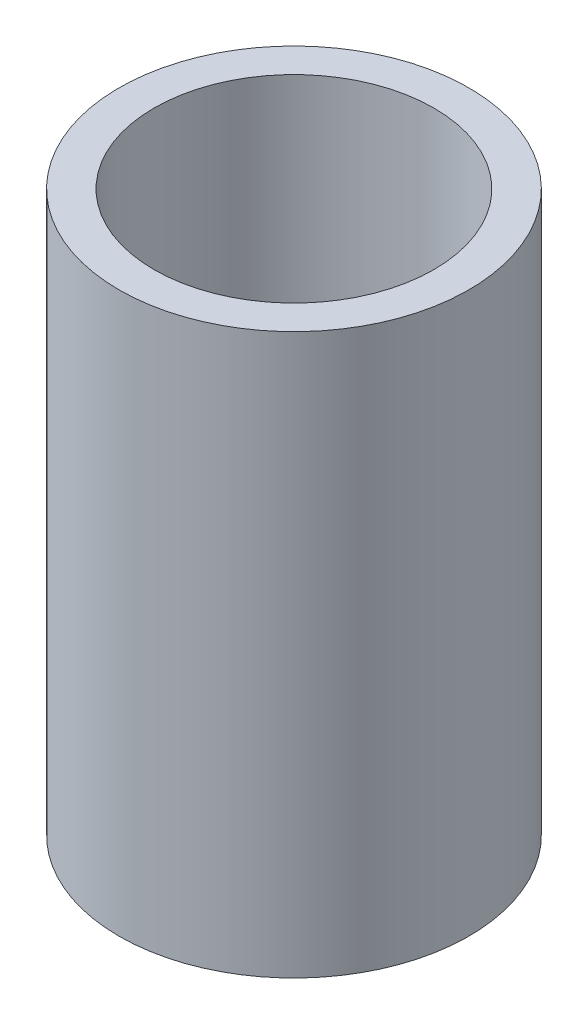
from build123d import *

# Parameters (mm, degrees)
SKETCH1_R           = 7.5
SKETCH1_R_2         = 6
BOSS_EXTRUDE1_DEPTH = 12


with BuildPart() as part:
    # Sketch1 → Boss-Extrude1 (new, symmetric)
    with BuildSketch(Plane(origin=(0, 0, 0), x_dir=(1, 0, 0), z_dir=(0, 1, 0))):
        with Locations(Location((0, 0, 0), (0, 0, 270))):
            Circle(SKETCH1_R)
        with Locations(Location((0, 0, 0), (0, 0, 270))):
            Circle(SKETCH1_R_2, mode=Mode.SUBTRACT)
    extrude(amount=BOSS_EXTRUDE1_DEPTH, both=True)


solid = part.part
